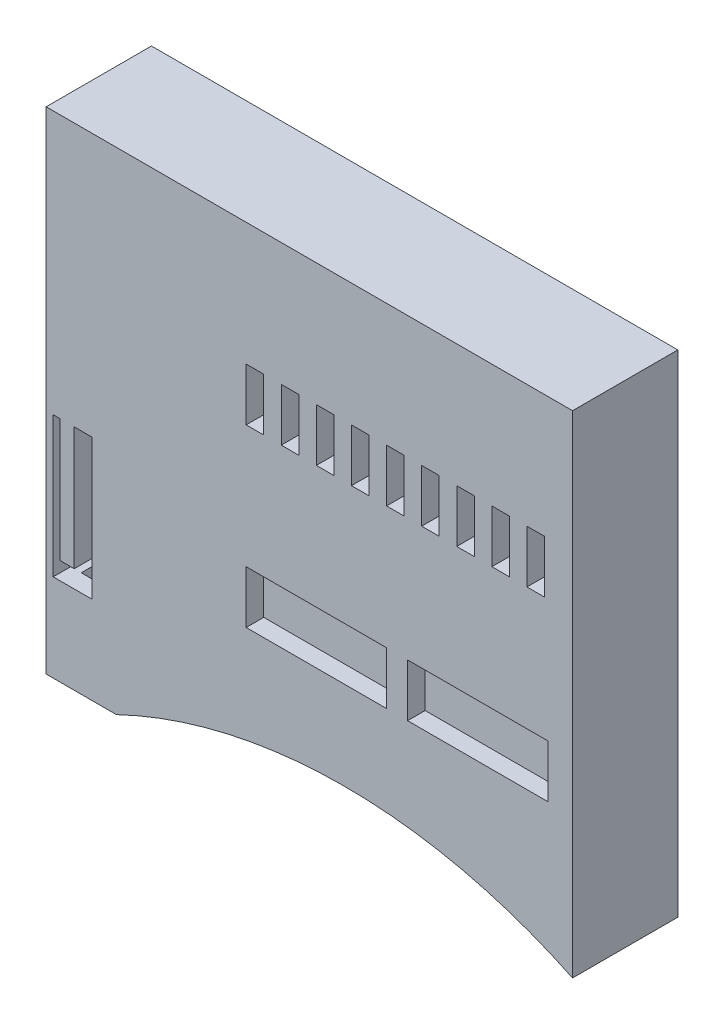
from build123d import *

# Parameters (mm, degrees)
SKETCH_1_W          = 15
SKETCH_1_H          = 14
EXTRUDE_1_DEPTH     = 3
SHELL_1_T           = -0.5
CUT_EXTRUDE_START   = -3
SKETCH_2_W          = 4
SKETCH_2_H          = 1.5
CUT_EXTRUDE_1_DEPTH = 3
SKETCH_3_W          = 0.5
SKETCH_3_H          = 1.5
CUT_EXTRUDE_2_DEPTH = 10
CUT_EXTRUDE_3_DEPTH = 11.688779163


with BuildPart() as part:
    # Sketch 1 → Extrude 1 (new body)
    with BuildSketch(Plane.XY):
        Rectangle(SKETCH_1_W, SKETCH_1_H)
    extrude(amount=EXTRUDE_1_DEPTH)

    # Shell 1
    shell_1_openings = [part.faces().sort_by_distance(p)[0] for p in [
        (0, -7, 1.5),
    ]]
    offset(amount=SHELL_1_T, openings=shell_1_openings, kind=Kind.INTERSECTION)

    # Sketch 2 → Cut-Extrude 1 (cut)
    with BuildSketch(Plane.XY.offset(3).offset(CUT_EXTRUDE_START)):
        with BuildLine():
            Line((-5.5, -7), (7.5, -7))
            ThreePointArc((7.5, -7), (1, -5.518505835), (-5.5, -7))
        make_face()
        with Locations((4.8, -2.25)):
            Rectangle(SKETCH_2_W, SKETCH_2_H)
        with Locations((0.2, -2.25)):
            Rectangle(SKETCH_2_W, SKETCH_2_H)
    extrude(amount=CUT_EXTRUDE_1_DEPTH, mode=Mode.SUBTRACT)

    # Sketch 3 → Cut-Extrude 2 (cut)
    with BuildSketch(Plane.XY.offset(3)):
        with Locations((-1.55, 2.75)):
            Rectangle(SKETCH_3_W, SKETCH_3_H)
        with Locations((-0.55, 2.75)):
            Rectangle(SKETCH_3_W, SKETCH_3_H)
        with Locations((0.45, 2.75)):
            Rectangle(SKETCH_3_W, SKETCH_3_H)
        with Locations((1.45, 2.75)):
            Rectangle(SKETCH_3_W, SKETCH_3_H)
        with Locations((2.45, 2.75)):
            Rectangle(SKETCH_3_W, SKETCH_3_H)
        with Locations((3.45, 2.75)):
            Rectangle(SKETCH_3_W, SKETCH_3_H)
        with Locations((4.45, 2.75)):
            Rectangle(SKETCH_3_W, SKETCH_3_H)
        with Locations((5.45, 2.75)):
            Rectangle(SKETCH_3_W, SKETCH_3_H)
        with Locations((6.45, 2.75)):
            Rectangle(SKETCH_3_W, SKETCH_3_H)
    extrude(amount=-CUT_EXTRUDE_2_DEPTH, mode=Mode.SUBTRACT)

    # Sketch 4 → Cut-Extrude 3 (cut, through all)
    with BuildSketch(Plane.XY.offset(3)):
        Polygon((-6.581693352, -4.5), (-7.3, -4.5), (-7.3, -0.5), (-7.1, -0.5), (-7.1, -4), (-6.7, -4), (-6.7, -0.5), (-6.2, -0.5), (-6.2, -4.5), align=None)
    extrude(amount=-CUT_EXTRUDE_3_DEPTH, mode=Mode.SUBTRACT)


solid = part.part
